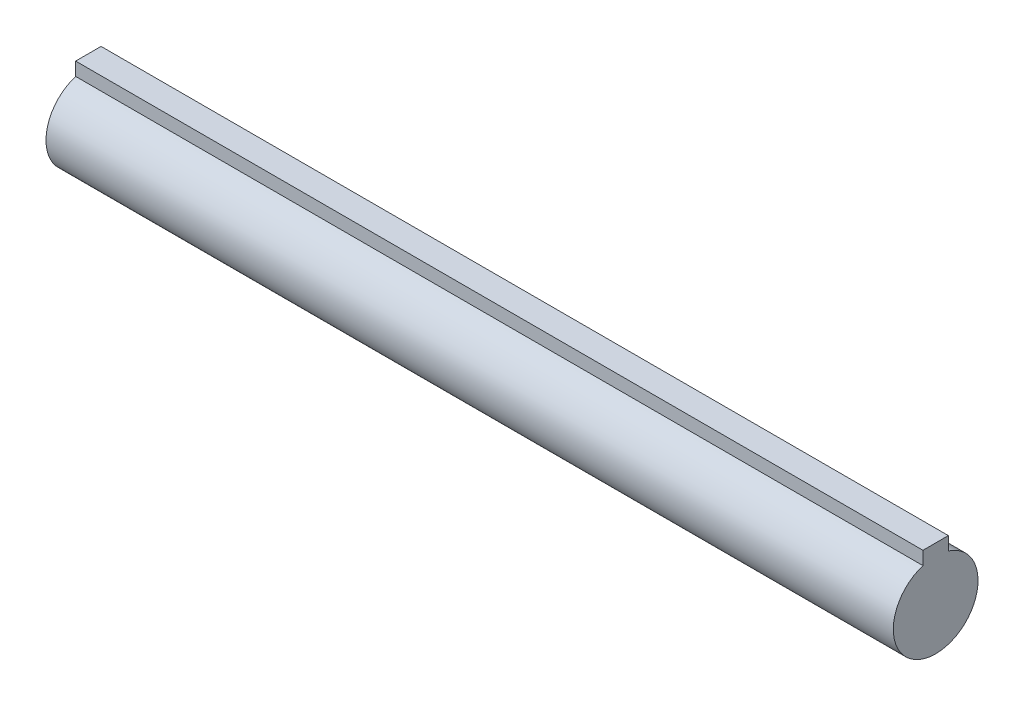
ISO-10303-21;
HEADER;
FILE_DESCRIPTION(('STEP AP214'),'2;1');
FILE_NAME('part.step','',(''),(''),'','','');
FILE_SCHEMA(('AUTOMOTIVE_DESIGN { 1 0 10303 214 1 1 1 1 }'));
ENDSEC;
DATA;
#1=APPLICATION_CONTEXT('core data for automotive mechanical design processes');
#2=APPLICATION_PROTOCOL_DEFINITION('international standard','automotive_design',2000,#1);
#3=PRODUCT_CONTEXT('',#1,'mechanical');
#4=PRODUCT('Part','Part','',(#3));
#5=PRODUCT_RELATED_PRODUCT_CATEGORY('part','',(#4));
#6=PRODUCT_DEFINITION_FORMATION('','',#4);
#7=PRODUCT_DEFINITION_CONTEXT('part definition',#1,'design');
#8=PRODUCT_DEFINITION('design','',#6,#7);
#9=PRODUCT_DEFINITION_SHAPE('','',#8);
#10=(LENGTH_UNIT() NAMED_UNIT(*) SI_UNIT(.MILLI.,.METRE.));
#11=(NAMED_UNIT(*) PLANE_ANGLE_UNIT() SI_UNIT($,.RADIAN.));
#12=(NAMED_UNIT(*) SI_UNIT($,.STERADIAN.) SOLID_ANGLE_UNIT());
#13=UNCERTAINTY_MEASURE_WITH_UNIT(LENGTH_MEASURE(1.E-05),#10,'distance_accuracy_value','');
#14=(GEOMETRIC_REPRESENTATION_CONTEXT(3) GLOBAL_UNCERTAINTY_ASSIGNED_CONTEXT((#13)) GLOBAL_UNIT_ASSIGNED_CONTEXT((#10,
#11,#12)) REPRESENTATION_CONTEXT('',''));
#15=CARTESIAN_POINT('',(0.,0.,0.));
#16=DIRECTION('',(0.,0.,1.));
#17=DIRECTION('',(1.,0.,0.));
#18=AXIS2_PLACEMENT_3D('',#15,#16,#17);
#19=CARTESIAN_POINT('',(0.,0.,0.));
#20=DIRECTION('',(1.,0.,0.));
#21=DIRECTION('',(0.,0.,-1.));
#22=AXIS2_PLACEMENT_3D('',#19,#20,#21);
#23=PLANE('',#22);
#24=CARTESIAN_POINT('',(0.,0.,0.));
#25=DIRECTION('',(1.,0.,0.));
#26=DIRECTION('',(0.,0.,-1.));
#27=AXIS2_PLACEMENT_3D('',#24,#25,#26);
#28=CIRCLE('',#27,9.99999999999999);
#29=CARTESIAN_POINT('',(0.,9.53939201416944,3.00000000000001));
#30=VERTEX_POINT('',#29);
#31=CARTESIAN_POINT('',(0.,9.53939201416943,-3.));
#32=VERTEX_POINT('',#31);
#33=EDGE_CURVE('E11',#30,#32,#28,.T.);
#34=ORIENTED_EDGE('',*,*,#33,.T.);
#35=DIRECTION('',(0.,1.,0.));
#36=VECTOR('',#35,1.);
#37=CARTESIAN_POINT('',(0.,12.68,-3.));
#38=LINE('',#37,#36);
#39=CARTESIAN_POINT('',(0.,12.68,-3.));
#40=VERTEX_POINT('',#39);
#41=EDGE_CURVE('E70',#32,#40,#38,.T.);
#42=ORIENTED_EDGE('',*,*,#41,.T.);
#43=DIRECTION('',(0.,0.,1.));
#44=VECTOR('',#43,1.);
#45=CARTESIAN_POINT('',(0.,12.68,3.));
#46=LINE('',#45,#44);
#47=CARTESIAN_POINT('',(0.,12.68,3.));
#48=VERTEX_POINT('',#47);
#49=EDGE_CURVE('E73',#40,#48,#46,.T.);
#50=ORIENTED_EDGE('',*,*,#49,.T.);
#51=DIRECTION('',(0.,-1.,0.));
#52=VECTOR('',#51,1.);
#53=CARTESIAN_POINT('',(0.,12.68,3.));
#54=LINE('',#53,#52);
#55=EDGE_CURVE('E45',#48,#30,#54,.T.);
#56=ORIENTED_EDGE('',*,*,#55,.T.);
#57=EDGE_LOOP('',(#34,#42,#50,#56));
#58=FACE_BOUND('',#57,.T.);
#59=ADVANCED_FACE('F32',(#58),#23,.T.);
#60=CARTESIAN_POINT('',(83.373357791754,0.,0.));
#61=DIRECTION('',(1.,0.,0.));
#62=DIRECTION('',(0.,0.,-1.));
#63=AXIS2_PLACEMENT_3D('',#60,#61,#62);
#64=CYLINDRICAL_SURFACE('',#63,9.99999999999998);
#65=DIRECTION('',(1.,0.,0.));
#66=VECTOR('',#65,1.);
#67=CARTESIAN_POINT('',(83.373357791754,9.53939201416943,3.));
#68=LINE('',#67,#66);
#69=CARTESIAN_POINT('',(-200.,9.53939201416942,3.));
#70=VERTEX_POINT('',#69);
#71=EDGE_CURVE('E99',#70,#30,#68,.T.);
#72=ORIENTED_EDGE('',*,*,#71,.F.);
#73=CARTESIAN_POINT('',(-200.,0.,0.));
#74=DIRECTION('',(1.,0.,0.));
#75=DIRECTION('',(0.,0.,-1.));
#76=AXIS2_PLACEMENT_3D('',#73,#74,#75);
#77=CIRCLE('',#76,9.99999999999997);
#78=CARTESIAN_POINT('',(-200.,9.53939201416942,-3.));
#79=VERTEX_POINT('',#78);
#80=EDGE_CURVE('E39',#70,#79,#77,.T.);
#81=ORIENTED_EDGE('',*,*,#80,.T.);
#82=DIRECTION('',(1.,0.,0.));
#83=VECTOR('',#82,1.);
#84=CARTESIAN_POINT('',(83.373357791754,9.53939201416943,-3.));
#85=LINE('',#84,#83);
#86=EDGE_CURVE('E96',#32,#79,#85,.F.);
#87=ORIENTED_EDGE('',*,*,#86,.F.);
#88=ORIENTED_EDGE('',*,*,#33,.F.);
#89=EDGE_LOOP('',(#72,#81,#87,#88));
#90=FACE_BOUND('',#89,.T.);
#91=ADVANCED_FACE('F103',(#90),#64,.T.);
#92=CARTESIAN_POINT('',(-200.,0.,0.));
#93=DIRECTION('',(-1.,0.,0.));
#94=DIRECTION('',(0.,0.,1.));
#95=AXIS2_PLACEMENT_3D('',#92,#93,#94);
#96=PLANE('',#95);
#97=ORIENTED_EDGE('',*,*,#80,.F.);
#98=DIRECTION('',(0.,-1.,0.));
#99=VECTOR('',#98,1.);
#100=CARTESIAN_POINT('',(-200.,12.68,3.));
#101=LINE('',#100,#99);
#102=CARTESIAN_POINT('',(-200.,12.68,3.));
#103=VERTEX_POINT('',#102);
#104=EDGE_CURVE('E52',#103,#70,#101,.T.);
#105=ORIENTED_EDGE('',*,*,#104,.F.);
#106=DIRECTION('',(0.,0.,1.));
#107=VECTOR('',#106,1.);
#108=CARTESIAN_POINT('',(-200.,12.68,3.));
#109=LINE('',#108,#107);
#110=CARTESIAN_POINT('',(-200.,12.68,-3.));
#111=VERTEX_POINT('',#110);
#112=EDGE_CURVE('E87',#111,#103,#109,.T.);
#113=ORIENTED_EDGE('',*,*,#112,.F.);
#114=DIRECTION('',(0.,1.,0.));
#115=VECTOR('',#114,1.);
#116=CARTESIAN_POINT('',(-200.,12.68,-3.));
#117=LINE('',#116,#115);
#118=EDGE_CURVE('E82',#79,#111,#117,.T.);
#119=ORIENTED_EDGE('',*,*,#118,.F.);
#120=EDGE_LOOP('',(#97,#105,#113,#119));
#121=FACE_BOUND('',#120,.T.);
#122=ADVANCED_FACE('F105',(#121),#96,.T.);
#123=CARTESIAN_POINT('',(-200.,12.68,3.));
#124=DIRECTION('',(0.,0.,1.));
#125=DIRECTION('',(0.,-1.,0.));
#126=AXIS2_PLACEMENT_3D('',#123,#124,#125);
#127=PLANE('',#126);
#128=ORIENTED_EDGE('',*,*,#104,.T.);
#129=ORIENTED_EDGE('',*,*,#71,.T.);
#130=ORIENTED_EDGE('',*,*,#55,.F.);
#131=DIRECTION('',(1.,0.,0.));
#132=VECTOR('',#131,1.);
#133=CARTESIAN_POINT('',(-200.,12.68,3.));
#134=LINE('',#133,#132);
#135=EDGE_CURVE('E86',#103,#48,#134,.T.);
#136=ORIENTED_EDGE('',*,*,#135,.F.);
#137=EDGE_LOOP('',(#128,#129,#130,#136));
#138=FACE_BOUND('',#137,.T.);
#139=ADVANCED_FACE('F107',(#138),#127,.T.);
#140=CARTESIAN_POINT('',(-200.,12.68,3.));
#141=DIRECTION('',(0.,1.,0.));
#142=DIRECTION('',(0.,0.,1.));
#143=AXIS2_PLACEMENT_3D('',#140,#141,#142);
#144=PLANE('',#143);
#145=ORIENTED_EDGE('',*,*,#49,.F.);
#146=DIRECTION('',(1.,0.,0.));
#147=VECTOR('',#146,1.);
#148=CARTESIAN_POINT('',(-200.,12.68,-3.));
#149=LINE('',#148,#147);
#150=EDGE_CURVE('E79',#111,#40,#149,.T.);
#151=ORIENTED_EDGE('',*,*,#150,.F.);
#152=ORIENTED_EDGE('',*,*,#112,.T.);
#153=ORIENTED_EDGE('',*,*,#135,.T.);
#154=EDGE_LOOP('',(#145,#151,#152,#153));
#155=FACE_BOUND('',#154,.T.);
#156=ADVANCED_FACE('F89',(#155),#144,.T.);
#157=CARTESIAN_POINT('',(-200.,12.68,-3.));
#158=DIRECTION('',(0.,0.,-1.));
#159=DIRECTION('',(0.,1.,0.));
#160=AXIS2_PLACEMENT_3D('',#157,#158,#159);
#161=PLANE('',#160);
#162=ORIENTED_EDGE('',*,*,#41,.F.);
#163=ORIENTED_EDGE('',*,*,#86,.T.);
#164=ORIENTED_EDGE('',*,*,#118,.T.);
#165=ORIENTED_EDGE('',*,*,#150,.T.);
#166=EDGE_LOOP('',(#162,#163,#164,#165));
#167=FACE_BOUND('',#166,.T.);
#168=ADVANCED_FACE('F80',(#167),#161,.T.);
#169=CLOSED_SHELL('',(#59,#91,#122,#139,#156,#168));
#170=MANIFOLD_SOLID_BREP('B2',#169);
#171=ADVANCED_BREP_SHAPE_REPRESENTATION('',(#18,#170),#14);
#172=SHAPE_DEFINITION_REPRESENTATION(#9,#171);
ENDSEC;
END-ISO-10303-21;
